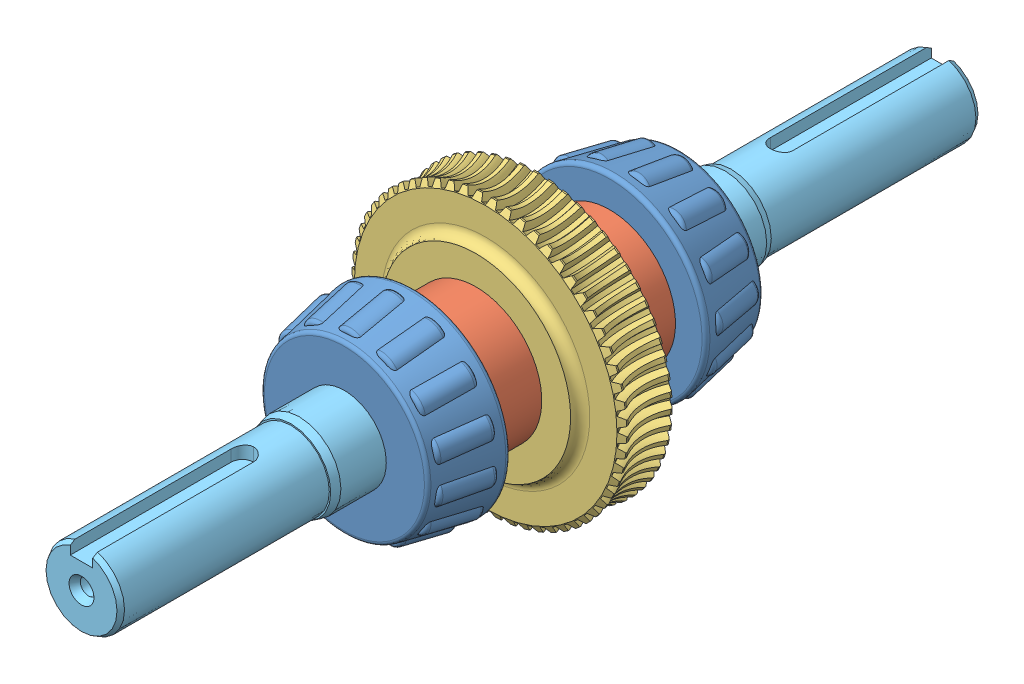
SolidWorks assembly Output Shaft Assembly.sldasm, configuration Default (file format 4888). Lengths in mm.
Overall size (58.65 58.65 180).
7 component instances, 5 part files, 6 mates.
Components (placement in the parent):
- Taper Bearing-1: Taper Bearing.SLDPRT [Default] at (0 0 20.4246) x (0 0 -1) z (0.870936 0.491397 0) size (14.61 40.73 40.12)
- Taper Bearing-2: Taper Bearing.SLDPRT [Default] at (0 0 -20.4246) x (0 0 1) z (-0.987808 0.155677 0) size (14.61 40.73 40.12)
- sleeve-1: sleeve.SLDPRT [Default] at (0 0 20.4246) x (-0.998502 -0.054709 0) z (0.054709 -0.998502 0) size (27.5 12.9 27.5)
- sleeve-2: sleeve.SLDPRT [Default] at (0 0 -7.5246) x (-0.998502 -0.054709 0) z (0.054709 -0.998502 0) size (27.5 12.9 27.5)
- Gear-1: Gear.SLDPRT [Default] x (-1 0 0) z (0 0 -1) size (58.65 58.65 15)
- key-1: key.SLDPRT [Default] at (0 6.75 0) x (0 0 -1) z (1 0 0) size (14 4 4.5)
- Output Shaft-1: Output Shaft.SLDPRT [Default] at origin size (17.5 17.5 180)
Mates (geometry in assembly coordinates):
- Lock2: lock: unknown of ?; unknown of ?
- Lock1: lock: unknown of ?; unknown of ?
- Lock4: lock: unknown of ?; unknown of ?
- Lock3: lock: unknown of ?; unknown of ?
- Lock6: lock: unknown of ?; unknown of ?
- Lock5: lock: unknown of ?; unknown of ?
